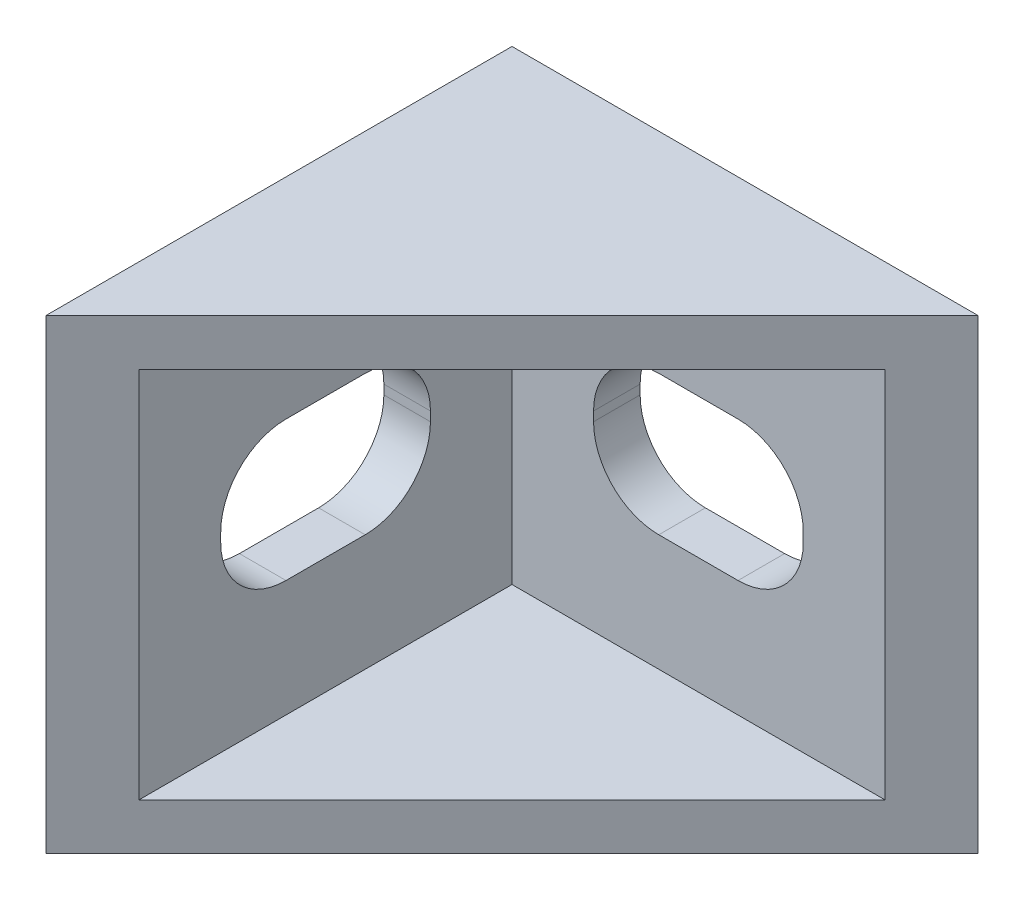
ISO-10303-21;
HEADER;
FILE_DESCRIPTION(('STEP AP214'),'2;1');
FILE_NAME('part.step','',(''),(''),'','','');
FILE_SCHEMA(('AUTOMOTIVE_DESIGN { 1 0 10303 214 1 1 1 1 }'));
ENDSEC;
DATA;
#1=APPLICATION_CONTEXT('core data for automotive mechanical design processes');
#2=APPLICATION_PROTOCOL_DEFINITION('international standard','automotive_design',2000,#1);
#3=PRODUCT_CONTEXT('',#1,'mechanical');
#4=PRODUCT('Part','Part','',(#3));
#5=PRODUCT_RELATED_PRODUCT_CATEGORY('part','',(#4));
#6=PRODUCT_DEFINITION_FORMATION('','',#4);
#7=PRODUCT_DEFINITION_CONTEXT('part definition',#1,'design');
#8=PRODUCT_DEFINITION('design','',#6,#7);
#9=PRODUCT_DEFINITION_SHAPE('','',#8);
#10=(LENGTH_UNIT() NAMED_UNIT(*) SI_UNIT(.MILLI.,.METRE.));
#11=(NAMED_UNIT(*) PLANE_ANGLE_UNIT() SI_UNIT($,.RADIAN.));
#12=(NAMED_UNIT(*) SI_UNIT($,.STERADIAN.) SOLID_ANGLE_UNIT());
#13=UNCERTAINTY_MEASURE_WITH_UNIT(LENGTH_MEASURE(1.E-05),#10,'distance_accuracy_value','');
#14=(GEOMETRIC_REPRESENTATION_CONTEXT(3) GLOBAL_UNCERTAINTY_ASSIGNED_CONTEXT((#13)) GLOBAL_UNIT_ASSIGNED_CONTEXT((#10,
#11,#12)) REPRESENTATION_CONTEXT('',''));
#15=CARTESIAN_POINT('',(0.,0.,0.));
#16=DIRECTION('',(0.,0.,1.));
#17=DIRECTION('',(1.,0.,0.));
#18=AXIS2_PLACEMENT_3D('',#15,#16,#17);
#19=CARTESIAN_POINT('',(0.,20.,20.));
#20=DIRECTION('',(-0.707106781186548,0.,-0.707106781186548));
#21=DIRECTION('',(-0.707106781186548,0.,0.707106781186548));
#22=AXIS2_PLACEMENT_3D('',#19,#20,#21);
#23=PLANE('',#22);
#24=DIRECTION('',(0.707106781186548,0.,-0.707106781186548));
#25=VECTOR('',#24,1.);
#26=CARTESIAN_POINT('',(0.,0.,20.));
#27=LINE('',#26,#25);
#28=CARTESIAN_POINT('',(0.,0.,20.));
#29=VERTEX_POINT('',#28);
#30=CARTESIAN_POINT('',(20.,0.,0.));
#31=VERTEX_POINT('',#30);
#32=EDGE_CURVE('E423',#29,#31,#27,.T.);
#33=ORIENTED_EDGE('',*,*,#32,.T.);
#34=DIRECTION('',(0.,-1.,0.));
#35=VECTOR('',#34,1.);
#36=CARTESIAN_POINT('',(20.,20.,0.));
#37=LINE('',#36,#35);
#38=CARTESIAN_POINT('',(20.,20.,0.));
#39=VERTEX_POINT('',#38);
#40=EDGE_CURVE('E54',#39,#31,#37,.T.);
#41=ORIENTED_EDGE('',*,*,#40,.F.);
#42=DIRECTION('',(0.707106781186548,0.,-0.707106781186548));
#43=VECTOR('',#42,1.);
#44=CARTESIAN_POINT('',(0.,20.,20.));
#45=LINE('',#44,#43);
#46=CARTESIAN_POINT('',(0.,20.,20.));
#47=VERTEX_POINT('',#46);
#48=EDGE_CURVE('E412',#47,#39,#45,.T.);
#49=ORIENTED_EDGE('',*,*,#48,.F.);
#50=DIRECTION('',(0.,-1.,0.));
#51=VECTOR('',#50,1.);
#52=CARTESIAN_POINT('',(0.,20.,20.));
#53=LINE('',#52,#51);
#54=EDGE_CURVE('E11',#47,#29,#53,.T.);
#55=ORIENTED_EDGE('',*,*,#54,.T.);
#56=EDGE_LOOP('',(#33,#41,#49,#55));
#57=FACE_BOUND('',#56,.T.);
#58=DIRECTION('',(0.707106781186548,0.,-0.707106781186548));
#59=VECTOR('',#58,1.);
#60=CARTESIAN_POINT('',(0.,2.,20.));
#61=LINE('',#60,#59);
#62=CARTESIAN_POINT('',(2.,2.,18.));
#63=VERTEX_POINT('',#62);
#64=CARTESIAN_POINT('',(18.,2.,2.));
#65=VERTEX_POINT('',#64);
#66=EDGE_CURVE('E380',#63,#65,#61,.T.);
#67=ORIENTED_EDGE('',*,*,#66,.F.);
#68=DIRECTION('',(0.,-1.,0.));
#69=VECTOR('',#68,1.);
#70=CARTESIAN_POINT('',(2.,20.,18.));
#71=LINE('',#70,#69);
#72=CARTESIAN_POINT('',(2.,18.,18.));
#73=VERTEX_POINT('',#72);
#74=EDGE_CURVE('E396',#73,#63,#71,.T.);
#75=ORIENTED_EDGE('',*,*,#74,.F.);
#76=DIRECTION('',(0.707106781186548,0.,-0.707106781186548));
#77=VECTOR('',#76,1.);
#78=CARTESIAN_POINT('',(0.,18.,20.));
#79=LINE('',#78,#77);
#80=CARTESIAN_POINT('',(18.,18.,2.));
#81=VERTEX_POINT('',#80);
#82=EDGE_CURVE('E384',#73,#81,#79,.T.);
#83=ORIENTED_EDGE('',*,*,#82,.T.);
#84=DIRECTION('',(0.,-1.,0.));
#85=VECTOR('',#84,1.);
#86=CARTESIAN_POINT('',(18.,20.,2.));
#87=LINE('',#86,#85);
#88=EDGE_CURVE('E390',#81,#65,#87,.T.);
#89=ORIENTED_EDGE('',*,*,#88,.T.);
#90=EDGE_LOOP('',(#67,#75,#83,#89));
#91=FACE_BOUND('',#90,.T.);
#92=ADVANCED_FACE('F45',(#57,#91),#23,.F.);
#93=CARTESIAN_POINT('',(0.,20.,0.));
#94=DIRECTION('',(1.,0.,0.));
#95=DIRECTION('',(0.,0.,-1.));
#96=AXIS2_PLACEMENT_3D('',#93,#94,#95);
#97=PLANE('',#96);
#98=DIRECTION('',(0.,1.,0.));
#99=VECTOR('',#98,1.);
#100=CARTESIAN_POINT('',(0.,20.,5.5));
#101=LINE('',#100,#99);
#102=CARTESIAN_POINT('',(0.,9.80000000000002,5.5));
#103=VERTEX_POINT('',#102);
#104=CARTESIAN_POINT('',(0.,10.2,5.5));
#105=VERTEX_POINT('',#104);
#106=EDGE_CURVE('E368',#103,#105,#101,.T.);
#107=ORIENTED_EDGE('',*,*,#106,.T.);
#108=CARTESIAN_POINT('',(0.,10.2,8.3));
#109=DIRECTION('',(1.,0.,0.));
#110=DIRECTION('',(0.,0.,-1.));
#111=AXIS2_PLACEMENT_3D('',#108,#109,#110);
#112=CIRCLE('',#111,2.8);
#113=CARTESIAN_POINT('',(0.,13.,8.30000000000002));
#114=VERTEX_POINT('',#113);
#115=EDGE_CURVE('E372',#105,#114,#112,.T.);
#116=ORIENTED_EDGE('',*,*,#115,.T.);
#117=DIRECTION('',(0.,0.,1.));
#118=VECTOR('',#117,1.);
#119=CARTESIAN_POINT('',(0.,13.,0.));
#120=LINE('',#119,#118);
#121=CARTESIAN_POINT('',(0.,13.,11.7));
#122=VERTEX_POINT('',#121);
#123=EDGE_CURVE('E323',#114,#122,#120,.T.);
#124=ORIENTED_EDGE('',*,*,#123,.T.);
#125=CARTESIAN_POINT('',(0.,10.2,11.7));
#126=DIRECTION('',(1.,0.,0.));
#127=DIRECTION('',(0.,0.,-1.));
#128=AXIS2_PLACEMENT_3D('',#125,#126,#127);
#129=CIRCLE('',#128,2.8);
#130=CARTESIAN_POINT('',(0.,10.2,14.5));
#131=VERTEX_POINT('',#130);
#132=EDGE_CURVE('E348',#122,#131,#129,.T.);
#133=ORIENTED_EDGE('',*,*,#132,.T.);
#134=DIRECTION('',(0.,-1.,0.));
#135=VECTOR('',#134,1.);
#136=CARTESIAN_POINT('',(0.,20.,14.5));
#137=LINE('',#136,#135);
#138=CARTESIAN_POINT('',(0.,9.80000000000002,14.5));
#139=VERTEX_POINT('',#138);
#140=EDGE_CURVE('E352',#131,#139,#137,.T.);
#141=ORIENTED_EDGE('',*,*,#140,.T.);
#142=CARTESIAN_POINT('',(0.,9.8,11.7));
#143=DIRECTION('',(1.,0.,0.));
#144=DIRECTION('',(0.,0.,-1.));
#145=AXIS2_PLACEMENT_3D('',#142,#143,#144);
#146=CIRCLE('',#145,2.8);
#147=CARTESIAN_POINT('',(0.,7.,11.7));
#148=VERTEX_POINT('',#147);
#149=EDGE_CURVE('E356',#139,#148,#146,.T.);
#150=ORIENTED_EDGE('',*,*,#149,.T.);
#151=DIRECTION('',(0.,0.,-1.));
#152=VECTOR('',#151,1.);
#153=CARTESIAN_POINT('',(0.,7.,0.));
#154=LINE('',#153,#152);
#155=CARTESIAN_POINT('',(0.,7.,8.30000000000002));
#156=VERTEX_POINT('',#155);
#157=EDGE_CURVE('E360',#148,#156,#154,.T.);
#158=ORIENTED_EDGE('',*,*,#157,.T.);
#159=CARTESIAN_POINT('',(0.,9.8,8.3));
#160=DIRECTION('',(1.,0.,0.));
#161=DIRECTION('',(0.,0.,-1.));
#162=AXIS2_PLACEMENT_3D('',#159,#160,#161);
#163=CIRCLE('',#162,2.8);
#164=EDGE_CURVE('E364',#156,#103,#163,.T.);
#165=ORIENTED_EDGE('',*,*,#164,.T.);
#166=EDGE_LOOP('',(#107,#116,#124,#133,#141,#150,#158,#165));
#167=FACE_BOUND('',#166,.T.);
#168=DIRECTION('',(0.,0.,1.));
#169=VECTOR('',#168,1.);
#170=CARTESIAN_POINT('',(0.,0.,0.));
#171=LINE('',#170,#169);
#172=CARTESIAN_POINT('',(0.,0.,0.));
#173=VERTEX_POINT('',#172);
#174=EDGE_CURVE('E399',#173,#29,#171,.T.);
#175=ORIENTED_EDGE('',*,*,#174,.T.);
#176=ORIENTED_EDGE('',*,*,#54,.F.);
#177=DIRECTION('',(0.,0.,1.));
#178=VECTOR('',#177,1.);
#179=CARTESIAN_POINT('',(0.,20.,0.));
#180=LINE('',#179,#178);
#181=CARTESIAN_POINT('',(0.,20.,0.));
#182=VERTEX_POINT('',#181);
#183=EDGE_CURVE('E408',#182,#47,#180,.T.);
#184=ORIENTED_EDGE('',*,*,#183,.F.);
#185=DIRECTION('',(0.,-1.,0.));
#186=VECTOR('',#185,1.);
#187=CARTESIAN_POINT('',(0.,20.,0.));
#188=LINE('',#187,#186);
#189=EDGE_CURVE('E419',#182,#173,#188,.T.);
#190=ORIENTED_EDGE('',*,*,#189,.T.);
#191=EDGE_LOOP('',(#175,#176,#184,#190));
#192=FACE_BOUND('',#191,.T.);
#193=ADVANCED_FACE('F47',(#167,#192),#97,.F.);
#194=CARTESIAN_POINT('',(0.,20.,0.));
#195=DIRECTION('',(0.,0.,1.));
#196=DIRECTION('',(1.,0.,0.));
#197=AXIS2_PLACEMENT_3D('',#194,#195,#196);
#198=PLANE('',#197);
#199=DIRECTION('',(0.,1.,0.));
#200=VECTOR('',#199,1.);
#201=CARTESIAN_POINT('',(14.5,20.,0.));
#202=LINE('',#201,#200);
#203=CARTESIAN_POINT('',(14.5,9.80000000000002,0.));
#204=VERTEX_POINT('',#203);
#205=CARTESIAN_POINT('',(14.5,10.2,0.));
#206=VERTEX_POINT('',#205);
#207=EDGE_CURVE('E280',#204,#206,#202,.T.);
#208=ORIENTED_EDGE('',*,*,#207,.T.);
#209=CARTESIAN_POINT('',(11.7,10.2,0.));
#210=DIRECTION('',(0.,0.,1.));
#211=DIRECTION('',(1.,0.,0.));
#212=AXIS2_PLACEMENT_3D('',#209,#210,#211);
#213=CIRCLE('',#212,2.8);
#214=CARTESIAN_POINT('',(11.7,13.,0.));
#215=VERTEX_POINT('',#214);
#216=EDGE_CURVE('E284',#206,#215,#213,.T.);
#217=ORIENTED_EDGE('',*,*,#216,.T.);
#218=DIRECTION('',(-1.,0.,0.));
#219=VECTOR('',#218,1.);
#220=CARTESIAN_POINT('',(0.,13.,0.));
#221=LINE('',#220,#219);
#222=CARTESIAN_POINT('',(8.30000000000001,13.,0.));
#223=VERTEX_POINT('',#222);
#224=EDGE_CURVE('E243',#215,#223,#221,.T.);
#225=ORIENTED_EDGE('',*,*,#224,.T.);
#226=CARTESIAN_POINT('',(8.3,10.2,0.));
#227=DIRECTION('',(0.,0.,1.));
#228=DIRECTION('',(1.,0.,0.));
#229=AXIS2_PLACEMENT_3D('',#226,#227,#228);
#230=CIRCLE('',#229,2.8);
#231=CARTESIAN_POINT('',(5.5,10.2,0.));
#232=VERTEX_POINT('',#231);
#233=EDGE_CURVE('E201',#223,#232,#230,.T.);
#234=ORIENTED_EDGE('',*,*,#233,.T.);
#235=DIRECTION('',(0.,-1.,0.));
#236=VECTOR('',#235,1.);
#237=CARTESIAN_POINT('',(5.5,20.,0.));
#238=LINE('',#237,#236);
#239=CARTESIAN_POINT('',(5.5,9.8,0.));
#240=VERTEX_POINT('',#239);
#241=EDGE_CURVE('E264',#232,#240,#238,.T.);
#242=ORIENTED_EDGE('',*,*,#241,.T.);
#243=CARTESIAN_POINT('',(8.3,9.8,0.));
#244=DIRECTION('',(0.,0.,1.));
#245=DIRECTION('',(1.,0.,0.));
#246=AXIS2_PLACEMENT_3D('',#243,#244,#245);
#247=CIRCLE('',#246,2.8);
#248=CARTESIAN_POINT('',(8.30000000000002,7.,0.));
#249=VERTEX_POINT('',#248);
#250=EDGE_CURVE('E268',#240,#249,#247,.T.);
#251=ORIENTED_EDGE('',*,*,#250,.T.);
#252=DIRECTION('',(1.,0.,0.));
#253=VECTOR('',#252,1.);
#254=CARTESIAN_POINT('',(0.,7.,0.));
#255=LINE('',#254,#253);
#256=CARTESIAN_POINT('',(11.7,7.,0.));
#257=VERTEX_POINT('',#256);
#258=EDGE_CURVE('E272',#249,#257,#255,.T.);
#259=ORIENTED_EDGE('',*,*,#258,.T.);
#260=CARTESIAN_POINT('',(11.7,9.8,0.));
#261=DIRECTION('',(0.,0.,1.));
#262=DIRECTION('',(1.,0.,0.));
#263=AXIS2_PLACEMENT_3D('',#260,#261,#262);
#264=CIRCLE('',#263,2.8);
#265=EDGE_CURVE('E276',#257,#204,#264,.T.);
#266=ORIENTED_EDGE('',*,*,#265,.T.);
#267=EDGE_LOOP('',(#208,#217,#225,#234,#242,#251,#259,#266));
#268=FACE_BOUND('',#267,.T.);
#269=DIRECTION('',(-1.,0.,0.));
#270=VECTOR('',#269,1.);
#271=CARTESIAN_POINT('',(0.,0.,0.));
#272=LINE('',#271,#270);
#273=EDGE_CURVE('E413',#31,#173,#272,.T.);
#274=ORIENTED_EDGE('',*,*,#273,.T.);
#275=ORIENTED_EDGE('',*,*,#189,.F.);
#276=DIRECTION('',(-1.,0.,0.));
#277=VECTOR('',#276,1.);
#278=CARTESIAN_POINT('',(0.,20.,0.));
#279=LINE('',#278,#277);
#280=EDGE_CURVE('E416',#39,#182,#279,.T.);
#281=ORIENTED_EDGE('',*,*,#280,.F.);
#282=ORIENTED_EDGE('',*,*,#40,.T.);
#283=EDGE_LOOP('',(#274,#275,#281,#282));
#284=FACE_BOUND('',#283,.T.);
#285=ADVANCED_FACE('F436',(#268,#284),#198,.F.);
#286=CARTESIAN_POINT('',(0.,20.,0.));
#287=DIRECTION('',(0.,1.,0.));
#288=DIRECTION('',(0.,0.,1.));
#289=AXIS2_PLACEMENT_3D('',#286,#287,#288);
#290=PLANE('',#289);
#291=ORIENTED_EDGE('',*,*,#183,.T.);
#292=ORIENTED_EDGE('',*,*,#48,.T.);
#293=ORIENTED_EDGE('',*,*,#280,.T.);
#294=EDGE_LOOP('',(#291,#292,#293));
#295=FACE_BOUND('',#294,.T.);
#296=ADVANCED_FACE('F446',(#295),#290,.T.);
#297=CARTESIAN_POINT('',(0.,0.,0.));
#298=DIRECTION('',(0.,1.,0.));
#299=DIRECTION('',(0.,0.,1.));
#300=AXIS2_PLACEMENT_3D('',#297,#298,#299);
#301=PLANE('',#300);
#302=ORIENTED_EDGE('',*,*,#174,.F.);
#303=ORIENTED_EDGE('',*,*,#273,.F.);
#304=ORIENTED_EDGE('',*,*,#32,.F.);
#305=EDGE_LOOP('',(#302,#303,#304));
#306=FACE_BOUND('',#305,.T.);
#307=ADVANCED_FACE('F441',(#306),#301,.F.);
#308=CARTESIAN_POINT('',(2.,20.,0.));
#309=DIRECTION('',(1.,0.,0.));
#310=DIRECTION('',(0.,0.,-1.));
#311=AXIS2_PLACEMENT_3D('',#308,#309,#310);
#312=PLANE('',#311);
#313=CARTESIAN_POINT('',(2.,10.2,8.3));
#314=DIRECTION('',(1.,0.,0.));
#315=DIRECTION('',(0.,0.,1.));
#316=AXIS2_PLACEMENT_3D('',#313,#314,#315);
#317=CIRCLE('',#316,2.8);
#318=CARTESIAN_POINT('',(2.,10.2,5.5));
#319=VERTEX_POINT('',#318);
#320=CARTESIAN_POINT('',(2.,13.,8.30000000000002));
#321=VERTEX_POINT('',#320);
#322=EDGE_CURVE('E288',#319,#321,#317,.T.);
#323=ORIENTED_EDGE('',*,*,#322,.F.);
#324=DIRECTION('',(0.,1.,0.));
#325=VECTOR('',#324,1.);
#326=CARTESIAN_POINT('',(2.,9.80000000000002,5.5));
#327=LINE('',#326,#325);
#328=CARTESIAN_POINT('',(2.,9.80000000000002,5.5));
#329=VERTEX_POINT('',#328);
#330=EDGE_CURVE('E315',#329,#319,#327,.T.);
#331=ORIENTED_EDGE('',*,*,#330,.F.);
#332=CARTESIAN_POINT('',(2.,9.8,8.3));
#333=DIRECTION('',(1.,0.,0.));
#334=DIRECTION('',(0.,0.,1.));
#335=AXIS2_PLACEMENT_3D('',#332,#333,#334);
#336=CIRCLE('',#335,2.8);
#337=CARTESIAN_POINT('',(2.,7.,8.30000000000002));
#338=VERTEX_POINT('',#337);
#339=EDGE_CURVE('E311',#338,#329,#336,.T.);
#340=ORIENTED_EDGE('',*,*,#339,.F.);
#341=DIRECTION('',(0.,0.,-1.));
#342=VECTOR('',#341,1.);
#343=CARTESIAN_POINT('',(2.,7.,11.7));
#344=LINE('',#343,#342);
#345=CARTESIAN_POINT('',(2.,7.,11.7));
#346=VERTEX_POINT('',#345);
#347=EDGE_CURVE('E307',#346,#338,#344,.T.);
#348=ORIENTED_EDGE('',*,*,#347,.F.);
#349=CARTESIAN_POINT('',(2.,9.8,11.7));
#350=DIRECTION('',(1.,0.,0.));
#351=DIRECTION('',(0.,0.,1.));
#352=AXIS2_PLACEMENT_3D('',#349,#350,#351);
#353=CIRCLE('',#352,2.8);
#354=CARTESIAN_POINT('',(2.,9.80000000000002,14.5));
#355=VERTEX_POINT('',#354);
#356=EDGE_CURVE('E303',#355,#346,#353,.T.);
#357=ORIENTED_EDGE('',*,*,#356,.F.);
#358=DIRECTION('',(0.,-1.,0.));
#359=VECTOR('',#358,1.);
#360=CARTESIAN_POINT('',(2.,9.80000000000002,14.5));
#361=LINE('',#360,#359);
#362=CARTESIAN_POINT('',(2.,10.2,14.5));
#363=VERTEX_POINT('',#362);
#364=EDGE_CURVE('E299',#363,#355,#361,.T.);
#365=ORIENTED_EDGE('',*,*,#364,.F.);
#366=CARTESIAN_POINT('',(2.,10.2,11.7));
#367=DIRECTION('',(1.,0.,0.));
#368=DIRECTION('',(0.,0.,1.));
#369=AXIS2_PLACEMENT_3D('',#366,#367,#368);
#370=CIRCLE('',#369,2.8);
#371=CARTESIAN_POINT('',(2.,13.,11.7));
#372=VERTEX_POINT('',#371);
#373=EDGE_CURVE('E295',#372,#363,#370,.T.);
#374=ORIENTED_EDGE('',*,*,#373,.F.);
#375=DIRECTION('',(0.,0.,1.));
#376=VECTOR('',#375,1.);
#377=CARTESIAN_POINT('',(2.,13.,11.7));
#378=LINE('',#377,#376);
#379=EDGE_CURVE('E291',#321,#372,#378,.T.);
#380=ORIENTED_EDGE('',*,*,#379,.F.);
#381=EDGE_LOOP('',(#323,#331,#340,#348,#357,#365,#374,#380));
#382=FACE_BOUND('',#381,.T.);
#383=DIRECTION('',(0.,0.,1.));
#384=VECTOR('',#383,1.);
#385=CARTESIAN_POINT('',(2.,2.,0.));
#386=LINE('',#385,#384);
#387=CARTESIAN_POINT('',(2.,2.,2.));
#388=VERTEX_POINT('',#387);
#389=EDGE_CURVE('E376',#388,#63,#386,.T.);
#390=ORIENTED_EDGE('',*,*,#389,.F.);
#391=DIRECTION('',(0.,-1.,0.));
#392=VECTOR('',#391,1.);
#393=CARTESIAN_POINT('',(2.,20.,2.));
#394=LINE('',#393,#392);
#395=CARTESIAN_POINT('',(2.,18.,2.));
#396=VERTEX_POINT('',#395);
#397=EDGE_CURVE('E386',#396,#388,#394,.T.);
#398=ORIENTED_EDGE('',*,*,#397,.F.);
#399=DIRECTION('',(0.,0.,1.));
#400=VECTOR('',#399,1.);
#401=CARTESIAN_POINT('',(2.,18.,0.));
#402=LINE('',#401,#400);
#403=EDGE_CURVE('E381',#396,#73,#402,.T.);
#404=ORIENTED_EDGE('',*,*,#403,.T.);
#405=ORIENTED_EDGE('',*,*,#74,.T.);
#406=EDGE_LOOP('',(#390,#398,#404,#405));
#407=FACE_BOUND('',#406,.T.);
#408=ADVANCED_FACE('F459',(#382,#407),#312,.T.);
#409=CARTESIAN_POINT('',(0.,20.,2.));
#410=DIRECTION('',(0.,0.,1.));
#411=DIRECTION('',(1.,0.,0.));
#412=AXIS2_PLACEMENT_3D('',#409,#410,#411);
#413=PLANE('',#412);
#414=CARTESIAN_POINT('',(11.7,10.2,2.));
#415=DIRECTION('',(0.,0.,1.));
#416=DIRECTION('',(1.,0.,0.));
#417=AXIS2_PLACEMENT_3D('',#414,#415,#416);
#418=CIRCLE('',#417,2.8);
#419=CARTESIAN_POINT('',(14.5,10.2,2.));
#420=VERTEX_POINT('',#419);
#421=CARTESIAN_POINT('',(11.7,13.,2.));
#422=VERTEX_POINT('',#421);
#423=EDGE_CURVE('E69',#420,#422,#418,.T.);
#424=ORIENTED_EDGE('',*,*,#423,.F.);
#425=DIRECTION('',(0.,1.,0.));
#426=VECTOR('',#425,1.);
#427=CARTESIAN_POINT('',(14.5,9.80000000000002,2.));
#428=LINE('',#427,#426);
#429=CARTESIAN_POINT('',(14.5,9.80000000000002,2.));
#430=VERTEX_POINT('',#429);
#431=EDGE_CURVE('E236',#430,#420,#428,.T.);
#432=ORIENTED_EDGE('',*,*,#431,.F.);
#433=CARTESIAN_POINT('',(11.7,9.8,2.));
#434=DIRECTION('',(0.,0.,1.));
#435=DIRECTION('',(-1.,0.,0.));
#436=AXIS2_PLACEMENT_3D('',#433,#434,#435);
#437=CIRCLE('',#436,2.8);
#438=CARTESIAN_POINT('',(11.7,7.,2.));
#439=VERTEX_POINT('',#438);
#440=EDGE_CURVE('E232',#439,#430,#437,.T.);
#441=ORIENTED_EDGE('',*,*,#440,.F.);
#442=DIRECTION('',(1.,0.,0.));
#443=VECTOR('',#442,1.);
#444=CARTESIAN_POINT('',(8.30000000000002,7.,2.));
#445=LINE('',#444,#443);
#446=CARTESIAN_POINT('',(8.30000000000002,7.,2.));
#447=VERTEX_POINT('',#446);
#448=EDGE_CURVE('E228',#447,#439,#445,.T.);
#449=ORIENTED_EDGE('',*,*,#448,.F.);
#450=CARTESIAN_POINT('',(8.3,9.8,2.));
#451=DIRECTION('',(0.,0.,1.));
#452=DIRECTION('',(-1.,0.,0.));
#453=AXIS2_PLACEMENT_3D('',#450,#451,#452);
#454=CIRCLE('',#453,2.8);
#455=CARTESIAN_POINT('',(5.5,9.8,2.));
#456=VERTEX_POINT('',#455);
#457=EDGE_CURVE('E221',#456,#447,#454,.T.);
#458=ORIENTED_EDGE('',*,*,#457,.F.);
#459=DIRECTION('',(0.,-1.,0.));
#460=VECTOR('',#459,1.);
#461=CARTESIAN_POINT('',(5.5,9.80000000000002,2.));
#462=LINE('',#461,#460);
#463=CARTESIAN_POINT('',(5.5,10.2,2.));
#464=VERTEX_POINT('',#463);
#465=EDGE_CURVE('E217',#464,#456,#462,.T.);
#466=ORIENTED_EDGE('',*,*,#465,.F.);
#467=CARTESIAN_POINT('',(8.3,10.2,2.));
#468=DIRECTION('',(0.,0.,1.));
#469=DIRECTION('',(-1.,0.,0.));
#470=AXIS2_PLACEMENT_3D('',#467,#468,#469);
#471=CIRCLE('',#470,2.8);
#472=CARTESIAN_POINT('',(8.30000000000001,13.,2.));
#473=VERTEX_POINT('',#472);
#474=EDGE_CURVE('E198',#473,#464,#471,.T.);
#475=ORIENTED_EDGE('',*,*,#474,.F.);
#476=DIRECTION('',(-1.,0.,0.));
#477=VECTOR('',#476,1.);
#478=CARTESIAN_POINT('',(8.30000000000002,13.,2.));
#479=LINE('',#478,#477);
#480=EDGE_CURVE('E208',#422,#473,#479,.T.);
#481=ORIENTED_EDGE('',*,*,#480,.F.);
#482=EDGE_LOOP('',(#424,#432,#441,#449,#458,#466,#475,#481));
#483=FACE_BOUND('',#482,.T.);
#484=DIRECTION('',(-1.,0.,0.));
#485=VECTOR('',#484,1.);
#486=CARTESIAN_POINT('',(0.,2.,2.));
#487=LINE('',#486,#485);
#488=EDGE_CURVE('E385',#65,#388,#487,.T.);
#489=ORIENTED_EDGE('',*,*,#488,.F.);
#490=ORIENTED_EDGE('',*,*,#88,.F.);
#491=DIRECTION('',(-1.,0.,0.));
#492=VECTOR('',#491,1.);
#493=CARTESIAN_POINT('',(0.,18.,2.));
#494=LINE('',#493,#492);
#495=EDGE_CURVE('E391',#81,#396,#494,.T.);
#496=ORIENTED_EDGE('',*,*,#495,.T.);
#497=ORIENTED_EDGE('',*,*,#397,.T.);
#498=EDGE_LOOP('',(#489,#490,#496,#497));
#499=FACE_BOUND('',#498,.T.);
#500=ADVANCED_FACE('F213',(#483,#499),#413,.T.);
#501=CARTESIAN_POINT('',(0.,18.,0.));
#502=DIRECTION('',(0.,1.,0.));
#503=DIRECTION('',(0.,0.,1.));
#504=AXIS2_PLACEMENT_3D('',#501,#502,#503);
#505=PLANE('',#504);
#506=ORIENTED_EDGE('',*,*,#403,.F.);
#507=ORIENTED_EDGE('',*,*,#495,.F.);
#508=ORIENTED_EDGE('',*,*,#82,.F.);
#509=EDGE_LOOP('',(#506,#507,#508));
#510=FACE_BOUND('',#509,.T.);
#511=ADVANCED_FACE('F462',(#510),#505,.F.);
#512=CARTESIAN_POINT('',(0.,2.,0.));
#513=DIRECTION('',(0.,1.,0.));
#514=DIRECTION('',(0.,0.,1.));
#515=AXIS2_PLACEMENT_3D('',#512,#513,#514);
#516=PLANE('',#515);
#517=ORIENTED_EDGE('',*,*,#389,.T.);
#518=ORIENTED_EDGE('',*,*,#66,.T.);
#519=ORIENTED_EDGE('',*,*,#488,.T.);
#520=EDGE_LOOP('',(#517,#518,#519));
#521=FACE_BOUND('',#520,.T.);
#522=ADVANCED_FACE('F453',(#521),#516,.T.);
#523=CARTESIAN_POINT('',(-8.,10.2,8.3));
#524=DIRECTION('',(1.,0.,0.));
#525=DIRECTION('',(0.,0.,-1.));
#526=AXIS2_PLACEMENT_3D('',#523,#524,#525);
#527=CYLINDRICAL_SURFACE('',#526,2.8);
#528=DIRECTION('',(1.,0.,0.));
#529=VECTOR('',#528,1.);
#530=CARTESIAN_POINT('',(-8.,10.2,5.5));
#531=LINE('',#530,#529);
#532=EDGE_CURVE('E320',#105,#319,#531,.T.);
#533=ORIENTED_EDGE('',*,*,#532,.T.);
#534=ORIENTED_EDGE('',*,*,#322,.T.);
#535=DIRECTION('',(1.,0.,0.));
#536=VECTOR('',#535,1.);
#537=CARTESIAN_POINT('',(-8.,13.,8.30000000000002));
#538=LINE('',#537,#536);
#539=EDGE_CURVE('E319',#114,#321,#538,.T.);
#540=ORIENTED_EDGE('',*,*,#539,.F.);
#541=ORIENTED_EDGE('',*,*,#115,.F.);
#542=EDGE_LOOP('',(#533,#534,#540,#541));
#543=FACE_BOUND('',#542,.T.);
#544=ADVANCED_FACE('F468',(#543),#527,.F.);
#545=CARTESIAN_POINT('',(-8.,9.80000000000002,5.5));
#546=DIRECTION('',(0.,0.,-1.));
#547=DIRECTION('',(-1.,0.,0.));
#548=AXIS2_PLACEMENT_3D('',#545,#546,#547);
#549=PLANE('',#548);
#550=DIRECTION('',(1.,0.,0.));
#551=VECTOR('',#550,1.);
#552=CARTESIAN_POINT('',(-8.,9.80000000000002,5.5));
#553=LINE('',#552,#551);
#554=EDGE_CURVE('E324',#103,#329,#553,.T.);
#555=ORIENTED_EDGE('',*,*,#554,.T.);
#556=ORIENTED_EDGE('',*,*,#330,.T.);
#557=ORIENTED_EDGE('',*,*,#532,.F.);
#558=ORIENTED_EDGE('',*,*,#106,.F.);
#559=EDGE_LOOP('',(#555,#556,#557,#558));
#560=FACE_BOUND('',#559,.T.);
#561=ADVANCED_FACE('F518',(#560),#549,.F.);
#562=CARTESIAN_POINT('',(-8.,9.8,8.3));
#563=DIRECTION('',(1.,0.,0.));
#564=DIRECTION('',(0.,0.,-1.));
#565=AXIS2_PLACEMENT_3D('',#562,#563,#564);
#566=CYLINDRICAL_SURFACE('',#565,2.8);
#567=DIRECTION('',(1.,0.,0.));
#568=VECTOR('',#567,1.);
#569=CARTESIAN_POINT('',(-8.,7.,8.30000000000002));
#570=LINE('',#569,#568);
#571=EDGE_CURVE('E327',#156,#338,#570,.T.);
#572=ORIENTED_EDGE('',*,*,#571,.T.);
#573=ORIENTED_EDGE('',*,*,#339,.T.);
#574=ORIENTED_EDGE('',*,*,#554,.F.);
#575=ORIENTED_EDGE('',*,*,#164,.F.);
#576=EDGE_LOOP('',(#572,#573,#574,#575));
#577=FACE_BOUND('',#576,.T.);
#578=ADVANCED_FACE('F521',(#577),#566,.F.);
#579=CARTESIAN_POINT('',(-8.,7.,11.7));
#580=DIRECTION('',(0.,-1.,0.));
#581=DIRECTION('',(0.,0.,-1.));
#582=AXIS2_PLACEMENT_3D('',#579,#580,#581);
#583=PLANE('',#582);
#584=DIRECTION('',(1.,0.,0.));
#585=VECTOR('',#584,1.);
#586=CARTESIAN_POINT('',(-8.,7.,11.7));
#587=LINE('',#586,#585);
#588=EDGE_CURVE('E330',#148,#346,#587,.T.);
#589=ORIENTED_EDGE('',*,*,#588,.T.);
#590=ORIENTED_EDGE('',*,*,#347,.T.);
#591=ORIENTED_EDGE('',*,*,#571,.F.);
#592=ORIENTED_EDGE('',*,*,#157,.F.);
#593=EDGE_LOOP('',(#589,#590,#591,#592));
#594=FACE_BOUND('',#593,.T.);
#595=ADVANCED_FACE('F525',(#594),#583,.F.);
#596=CARTESIAN_POINT('',(-8.,9.8,11.7));
#597=DIRECTION('',(1.,0.,0.));
#598=DIRECTION('',(0.,0.,-1.));
#599=AXIS2_PLACEMENT_3D('',#596,#597,#598);
#600=CYLINDRICAL_SURFACE('',#599,2.8);
#601=DIRECTION('',(1.,0.,0.));
#602=VECTOR('',#601,1.);
#603=CARTESIAN_POINT('',(-8.,9.80000000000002,14.5));
#604=LINE('',#603,#602);
#605=EDGE_CURVE('E333',#139,#355,#604,.T.);
#606=ORIENTED_EDGE('',*,*,#605,.T.);
#607=ORIENTED_EDGE('',*,*,#356,.T.);
#608=ORIENTED_EDGE('',*,*,#588,.F.);
#609=ORIENTED_EDGE('',*,*,#149,.F.);
#610=EDGE_LOOP('',(#606,#607,#608,#609));
#611=FACE_BOUND('',#610,.T.);
#612=ADVANCED_FACE('F529',(#611),#600,.F.);
#613=CARTESIAN_POINT('',(-8.,9.80000000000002,14.5));
#614=DIRECTION('',(0.,0.,1.));
#615=DIRECTION('',(1.,0.,0.));
#616=AXIS2_PLACEMENT_3D('',#613,#614,#615);
#617=PLANE('',#616);
#618=DIRECTION('',(1.,0.,0.));
#619=VECTOR('',#618,1.);
#620=CARTESIAN_POINT('',(-8.,10.2,14.5));
#621=LINE('',#620,#619);
#622=EDGE_CURVE('E336',#131,#363,#621,.T.);
#623=ORIENTED_EDGE('',*,*,#622,.T.);
#624=ORIENTED_EDGE('',*,*,#364,.T.);
#625=ORIENTED_EDGE('',*,*,#605,.F.);
#626=ORIENTED_EDGE('',*,*,#140,.F.);
#627=EDGE_LOOP('',(#623,#624,#625,#626));
#628=FACE_BOUND('',#627,.T.);
#629=ADVANCED_FACE('F533',(#628),#617,.F.);
#630=CARTESIAN_POINT('',(-8.,10.2,11.7));
#631=DIRECTION('',(1.,0.,0.));
#632=DIRECTION('',(0.,0.,-1.));
#633=AXIS2_PLACEMENT_3D('',#630,#631,#632);
#634=CYLINDRICAL_SURFACE('',#633,2.8);
#635=DIRECTION('',(1.,0.,0.));
#636=VECTOR('',#635,1.);
#637=CARTESIAN_POINT('',(-8.,13.,11.7));
#638=LINE('',#637,#636);
#639=EDGE_CURVE('E339',#122,#372,#638,.T.);
#640=ORIENTED_EDGE('',*,*,#639,.T.);
#641=ORIENTED_EDGE('',*,*,#373,.T.);
#642=ORIENTED_EDGE('',*,*,#622,.F.);
#643=ORIENTED_EDGE('',*,*,#132,.F.);
#644=EDGE_LOOP('',(#640,#641,#642,#643));
#645=FACE_BOUND('',#644,.T.);
#646=ADVANCED_FACE('F512',(#645),#634,.F.);
#647=CARTESIAN_POINT('',(-8.,13.,11.7));
#648=DIRECTION('',(0.,1.,0.));
#649=DIRECTION('',(0.,0.,1.));
#650=AXIS2_PLACEMENT_3D('',#647,#648,#649);
#651=PLANE('',#650);
#652=ORIENTED_EDGE('',*,*,#539,.T.);
#653=ORIENTED_EDGE('',*,*,#379,.T.);
#654=ORIENTED_EDGE('',*,*,#639,.F.);
#655=ORIENTED_EDGE('',*,*,#123,.F.);
#656=EDGE_LOOP('',(#652,#653,#654,#655));
#657=FACE_BOUND('',#656,.T.);
#658=ADVANCED_FACE('F506',(#657),#651,.F.);
#659=CARTESIAN_POINT('',(11.7,10.2,-8.));
#660=DIRECTION('',(0.,0.,1.));
#661=DIRECTION('',(1.,0.,0.));
#662=AXIS2_PLACEMENT_3D('',#659,#660,#661);
#663=CYLINDRICAL_SURFACE('',#662,2.8);
#664=DIRECTION('',(0.,0.,1.));
#665=VECTOR('',#664,1.);
#666=CARTESIAN_POINT('',(14.5,10.2,-8.));
#667=LINE('',#666,#665);
#668=EDGE_CURVE('E240',#206,#420,#667,.T.);
#669=ORIENTED_EDGE('',*,*,#668,.T.);
#670=ORIENTED_EDGE('',*,*,#423,.T.);
#671=DIRECTION('',(0.,0.,1.));
#672=VECTOR('',#671,1.);
#673=CARTESIAN_POINT('',(11.7,13.,-8.));
#674=LINE('',#673,#672);
#675=EDGE_CURVE('E205',#215,#422,#674,.T.);
#676=ORIENTED_EDGE('',*,*,#675,.F.);
#677=ORIENTED_EDGE('',*,*,#216,.F.);
#678=EDGE_LOOP('',(#669,#670,#676,#677));
#679=FACE_BOUND('',#678,.T.);
#680=ADVANCED_FACE('F504',(#679),#663,.F.);
#681=CARTESIAN_POINT('',(14.5,9.80000000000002,-8.));
#682=DIRECTION('',(1.,0.,0.));
#683=DIRECTION('',(0.,0.,-1.));
#684=AXIS2_PLACEMENT_3D('',#681,#682,#683);
#685=PLANE('',#684);
#686=DIRECTION('',(0.,0.,1.));
#687=VECTOR('',#686,1.);
#688=CARTESIAN_POINT('',(14.5,9.80000000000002,-8.));
#689=LINE('',#688,#687);
#690=EDGE_CURVE('E244',#204,#430,#689,.T.);
#691=ORIENTED_EDGE('',*,*,#690,.T.);
#692=ORIENTED_EDGE('',*,*,#431,.T.);
#693=ORIENTED_EDGE('',*,*,#668,.F.);
#694=ORIENTED_EDGE('',*,*,#207,.F.);
#695=EDGE_LOOP('',(#691,#692,#693,#694));
#696=FACE_BOUND('',#695,.T.);
#697=ADVANCED_FACE('F488',(#696),#685,.F.);
#698=CARTESIAN_POINT('',(11.7,9.8,-8.));
#699=DIRECTION('',(0.,0.,1.));
#700=DIRECTION('',(1.,0.,0.));
#701=AXIS2_PLACEMENT_3D('',#698,#699,#700);
#702=CYLINDRICAL_SURFACE('',#701,2.8);
#703=DIRECTION('',(0.,0.,1.));
#704=VECTOR('',#703,1.);
#705=CARTESIAN_POINT('',(11.7,7.,-8.));
#706=LINE('',#705,#704);
#707=EDGE_CURVE('E247',#257,#439,#706,.T.);
#708=ORIENTED_EDGE('',*,*,#707,.T.);
#709=ORIENTED_EDGE('',*,*,#440,.T.);
#710=ORIENTED_EDGE('',*,*,#690,.F.);
#711=ORIENTED_EDGE('',*,*,#265,.F.);
#712=EDGE_LOOP('',(#708,#709,#710,#711));
#713=FACE_BOUND('',#712,.T.);
#714=ADVANCED_FACE('F490',(#713),#702,.F.);
#715=CARTESIAN_POINT('',(8.30000000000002,7.,-8.));
#716=DIRECTION('',(0.,-1.,0.));
#717=DIRECTION('',(0.,0.,-1.));
#718=AXIS2_PLACEMENT_3D('',#715,#716,#717);
#719=PLANE('',#718);
#720=DIRECTION('',(0.,0.,1.));
#721=VECTOR('',#720,1.);
#722=CARTESIAN_POINT('',(8.30000000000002,7.,-8.));
#723=LINE('',#722,#721);
#724=EDGE_CURVE('E250',#249,#447,#723,.T.);
#725=ORIENTED_EDGE('',*,*,#724,.T.);
#726=ORIENTED_EDGE('',*,*,#448,.T.);
#727=ORIENTED_EDGE('',*,*,#707,.F.);
#728=ORIENTED_EDGE('',*,*,#258,.F.);
#729=EDGE_LOOP('',(#725,#726,#727,#728));
#730=FACE_BOUND('',#729,.T.);
#731=ADVANCED_FACE('F497',(#730),#719,.F.);
#732=CARTESIAN_POINT('',(8.3,9.8,-8.));
#733=DIRECTION('',(0.,0.,1.));
#734=DIRECTION('',(1.,0.,0.));
#735=AXIS2_PLACEMENT_3D('',#732,#733,#734);
#736=CYLINDRICAL_SURFACE('',#735,2.8);
#737=DIRECTION('',(0.,0.,1.));
#738=VECTOR('',#737,1.);
#739=CARTESIAN_POINT('',(5.5,9.8,-8.));
#740=LINE('',#739,#738);
#741=EDGE_CURVE('E253',#240,#456,#740,.T.);
#742=ORIENTED_EDGE('',*,*,#741,.T.);
#743=ORIENTED_EDGE('',*,*,#457,.T.);
#744=ORIENTED_EDGE('',*,*,#724,.F.);
#745=ORIENTED_EDGE('',*,*,#250,.F.);
#746=EDGE_LOOP('',(#742,#743,#744,#745));
#747=FACE_BOUND('',#746,.T.);
#748=ADVANCED_FACE('F500',(#747),#736,.F.);
#749=CARTESIAN_POINT('',(5.5,9.80000000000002,-8.));
#750=DIRECTION('',(-1.,0.,0.));
#751=DIRECTION('',(0.,0.,1.));
#752=AXIS2_PLACEMENT_3D('',#749,#750,#751);
#753=PLANE('',#752);
#754=DIRECTION('',(0.,0.,1.));
#755=VECTOR('',#754,1.);
#756=CARTESIAN_POINT('',(5.5,10.2,-8.));
#757=LINE('',#756,#755);
#758=EDGE_CURVE('E204',#232,#464,#757,.T.);
#759=ORIENTED_EDGE('',*,*,#758,.T.);
#760=ORIENTED_EDGE('',*,*,#465,.T.);
#761=ORIENTED_EDGE('',*,*,#741,.F.);
#762=ORIENTED_EDGE('',*,*,#241,.F.);
#763=EDGE_LOOP('',(#759,#760,#761,#762));
#764=FACE_BOUND('',#763,.T.);
#765=ADVANCED_FACE('F503',(#764),#753,.F.);
#766=CARTESIAN_POINT('',(8.3,10.2,-8.));
#767=DIRECTION('',(0.,0.,1.));
#768=DIRECTION('',(1.,0.,0.));
#769=AXIS2_PLACEMENT_3D('',#766,#767,#768);
#770=CYLINDRICAL_SURFACE('',#769,2.8);
#771=DIRECTION('',(0.,0.,1.));
#772=VECTOR('',#771,1.);
#773=CARTESIAN_POINT('',(8.30000000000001,13.,-8.));
#774=LINE('',#773,#772);
#775=EDGE_CURVE('E61',#223,#473,#774,.T.);
#776=ORIENTED_EDGE('',*,*,#775,.T.);
#777=ORIENTED_EDGE('',*,*,#474,.T.);
#778=ORIENTED_EDGE('',*,*,#758,.F.);
#779=ORIENTED_EDGE('',*,*,#233,.F.);
#780=EDGE_LOOP('',(#776,#777,#778,#779));
#781=FACE_BOUND('',#780,.T.);
#782=ADVANCED_FACE('F195',(#781),#770,.F.);
#783=CARTESIAN_POINT('',(8.30000000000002,13.,-8.));
#784=DIRECTION('',(0.,1.,0.));
#785=DIRECTION('',(0.,0.,1.));
#786=AXIS2_PLACEMENT_3D('',#783,#784,#785);
#787=PLANE('',#786);
#788=ORIENTED_EDGE('',*,*,#675,.T.);
#789=ORIENTED_EDGE('',*,*,#480,.T.);
#790=ORIENTED_EDGE('',*,*,#775,.F.);
#791=ORIENTED_EDGE('',*,*,#224,.F.);
#792=EDGE_LOOP('',(#788,#789,#790,#791));
#793=FACE_BOUND('',#792,.T.);
#794=ADVANCED_FACE('F209',(#793),#787,.F.);
#795=CLOSED_SHELL('',(#92,#193,#285,#296,#307,#408,#500,#511,#522,#544,#561,#578,#595,#612,#629,
#646,#658,#680,#697,#714,#731,#748,#765,#782,#794));
#796=MANIFOLD_SOLID_BREP('B2',#795);
#797=ADVANCED_BREP_SHAPE_REPRESENTATION('',(#18,#796),#14);
#798=SHAPE_DEFINITION_REPRESENTATION(#9,#797);
ENDSEC;
END-ISO-10303-21;
